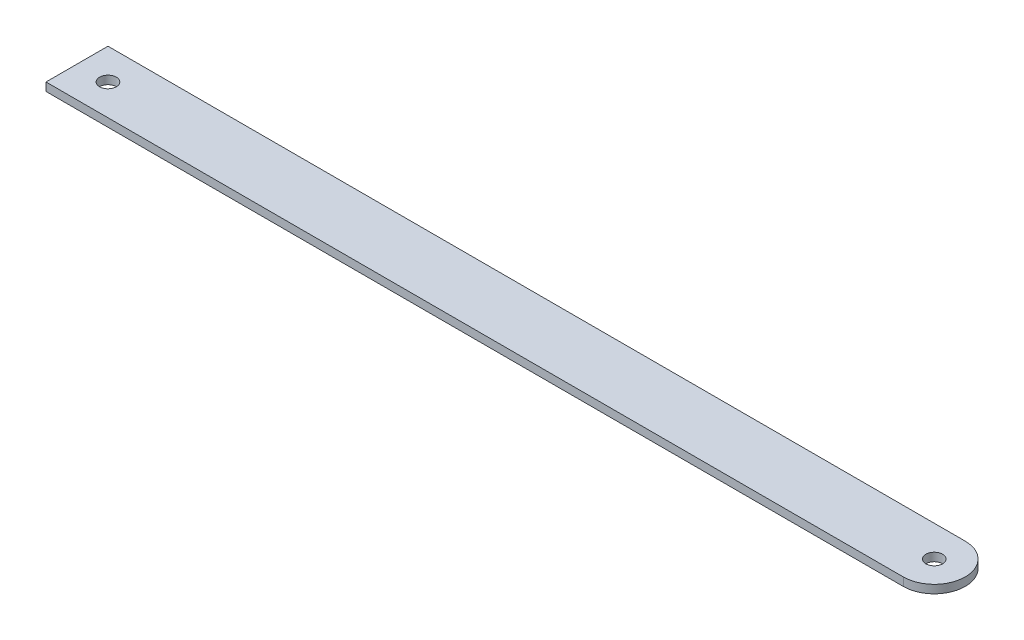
ISO-10303-21;
HEADER;
FILE_DESCRIPTION(('STEP AP214'),'2;1');
FILE_NAME('part.step','',(''),(''),'','','');
FILE_SCHEMA(('AUTOMOTIVE_DESIGN { 1 0 10303 214 1 1 1 1 }'));
ENDSEC;
DATA;
#1=APPLICATION_CONTEXT('core data for automotive mechanical design processes');
#2=APPLICATION_PROTOCOL_DEFINITION('international standard','automotive_design',2000,#1);
#3=PRODUCT_CONTEXT('',#1,'mechanical');
#4=PRODUCT('Part','Part','',(#3));
#5=PRODUCT_RELATED_PRODUCT_CATEGORY('part','',(#4));
#6=PRODUCT_DEFINITION_FORMATION('','',#4);
#7=PRODUCT_DEFINITION_CONTEXT('part definition',#1,'design');
#8=PRODUCT_DEFINITION('design','',#6,#7);
#9=PRODUCT_DEFINITION_SHAPE('','',#8);
#10=(LENGTH_UNIT() NAMED_UNIT(*) SI_UNIT(.MILLI.,.METRE.));
#11=(NAMED_UNIT(*) PLANE_ANGLE_UNIT() SI_UNIT($,.RADIAN.));
#12=(NAMED_UNIT(*) SI_UNIT($,.STERADIAN.) SOLID_ANGLE_UNIT());
#13=UNCERTAINTY_MEASURE_WITH_UNIT(LENGTH_MEASURE(1.E-05),#10,'distance_accuracy_value','');
#14=(GEOMETRIC_REPRESENTATION_CONTEXT(3) GLOBAL_UNCERTAINTY_ASSIGNED_CONTEXT((#13)) GLOBAL_UNIT_ASSIGNED_CONTEXT((#10,
#11,#12)) REPRESENTATION_CONTEXT('',''));
#15=CARTESIAN_POINT('',(0.,0.,0.));
#16=DIRECTION('',(0.,0.,1.));
#17=DIRECTION('',(1.,0.,0.));
#18=AXIS2_PLACEMENT_3D('',#15,#16,#17);
#19=CARTESIAN_POINT('',(2063.19961800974,4.,1775.27482915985));
#20=DIRECTION('',(0.,1.,0.));
#21=DIRECTION('',(0.,0.,-1.));
#22=AXIS2_PLACEMENT_3D('',#19,#20,#21);
#23=PLANE('',#22);
#24=CARTESIAN_POINT('',(2063.19961800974,4.,1775.27482915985));
#25=DIRECTION('',(0.,-1.,0.));
#26=DIRECTION('',(0.,0.,-1.));
#27=AXIS2_PLACEMENT_3D('',#24,#25,#26);
#28=CIRCLE('',#27,4.04999999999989);
#29=CARTESIAN_POINT('',(2063.19961800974,4.,1771.22482915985));
#30=VERTEX_POINT('',#29);
#31=EDGE_CURVE('E103',#30,#30,#28,.T.);
#32=ORIENTED_EDGE('',*,*,#31,.T.);
#33=EDGE_LOOP('',(#32));
#34=FACE_BOUND('',#33,.T.);
#35=CARTESIAN_POINT('',(2063.19961800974,4.,1775.27482915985));
#36=DIRECTION('',(0.,-1.,0.));
#37=DIRECTION('',(0.,0.,-1.));
#38=AXIS2_PLACEMENT_3D('',#35,#36,#37);
#39=CIRCLE('',#38,15.);
#40=CARTESIAN_POINT('',(2063.19961800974,4.,1760.27482915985));
#41=VERTEX_POINT('',#40);
#42=CARTESIAN_POINT('',(2063.19961800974,4.,1790.27482915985));
#43=VERTEX_POINT('',#42);
#44=EDGE_CURVE('E91',#41,#43,#39,.T.);
#45=ORIENTED_EDGE('',*,*,#44,.F.);
#46=DIRECTION('',(1.,0.,0.));
#47=VECTOR('',#46,1.);
#48=CARTESIAN_POINT('',(1648.19961800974,4.,1760.27482915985));
#49=LINE('',#48,#47);
#50=CARTESIAN_POINT('',(1648.19961800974,4.,1760.27482915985));
#51=VERTEX_POINT('',#50);
#52=EDGE_CURVE('E94',#51,#41,#49,.T.);
#53=ORIENTED_EDGE('',*,*,#52,.F.);
#54=DIRECTION('',(0.,0.,-1.));
#55=VECTOR('',#54,1.);
#56=CARTESIAN_POINT('',(1648.19961800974,4.,1790.27482915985));
#57=LINE('',#56,#55);
#58=CARTESIAN_POINT('',(1648.19961800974,4.,1790.27482915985));
#59=VERTEX_POINT('',#58);
#60=EDGE_CURVE('E82',#59,#51,#57,.T.);
#61=ORIENTED_EDGE('',*,*,#60,.F.);
#62=DIRECTION('',(-1.,0.,0.));
#63=VECTOR('',#62,1.);
#64=CARTESIAN_POINT('',(2063.19961800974,4.,1790.27482915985));
#65=LINE('',#64,#63);
#66=EDGE_CURVE('E87',#43,#59,#65,.T.);
#67=ORIENTED_EDGE('',*,*,#66,.F.);
#68=EDGE_LOOP('',(#45,#53,#61,#67));
#69=FACE_BOUND('',#68,.T.);
#70=CARTESIAN_POINT('',(1663.19961800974,4.,1775.27482915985));
#71=DIRECTION('',(0.,-1.,0.));
#72=DIRECTION('',(0.,0.,-1.));
#73=AXIS2_PLACEMENT_3D('',#70,#71,#72);
#74=CIRCLE('',#73,4.04999999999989);
#75=CARTESIAN_POINT('',(1663.19961800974,4.,1771.22482915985));
#76=VERTEX_POINT('',#75);
#77=EDGE_CURVE('E114',#76,#76,#74,.T.);
#78=ORIENTED_EDGE('',*,*,#77,.T.);
#79=EDGE_LOOP('',(#78));
#80=FACE_BOUND('',#79,.T.);
#81=ADVANCED_FACE('F35',(#34,#69,#80),#23,.T.);
#82=CARTESIAN_POINT('',(2063.19961800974,0.,1775.27482915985));
#83=DIRECTION('',(0.,1.,0.));
#84=DIRECTION('',(0.,0.,-1.));
#85=AXIS2_PLACEMENT_3D('',#82,#83,#84);
#86=PLANE('',#85);
#87=CARTESIAN_POINT('',(2063.19961800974,0.,1775.27482915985));
#88=DIRECTION('',(0.,-1.,0.));
#89=DIRECTION('',(0.,0.,-1.));
#90=AXIS2_PLACEMENT_3D('',#87,#88,#89);
#91=CIRCLE('',#90,4.04999999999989);
#92=CARTESIAN_POINT('',(2063.19961800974,0.,1771.22482915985));
#93=VERTEX_POINT('',#92);
#94=EDGE_CURVE('E111',#93,#93,#91,.T.);
#95=ORIENTED_EDGE('',*,*,#94,.F.);
#96=EDGE_LOOP('',(#95));
#97=FACE_BOUND('',#96,.T.);
#98=CARTESIAN_POINT('',(2063.19961800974,0.,1775.27482915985));
#99=DIRECTION('',(0.,-1.,0.));
#100=DIRECTION('',(0.,0.,-1.));
#101=AXIS2_PLACEMENT_3D('',#98,#99,#100);
#102=CIRCLE('',#101,15.);
#103=CARTESIAN_POINT('',(2063.19961800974,0.,1760.27482915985));
#104=VERTEX_POINT('',#103);
#105=CARTESIAN_POINT('',(2063.19961800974,0.,1790.27482915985));
#106=VERTEX_POINT('',#105);
#107=EDGE_CURVE('E99',#104,#106,#102,.T.);
#108=ORIENTED_EDGE('',*,*,#107,.T.);
#109=DIRECTION('',(-1.,0.,0.));
#110=VECTOR('',#109,1.);
#111=CARTESIAN_POINT('',(2063.19961800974,0.,1790.27482915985));
#112=LINE('',#111,#110);
#113=CARTESIAN_POINT('',(1648.19961800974,0.,1790.27482915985));
#114=VERTEX_POINT('',#113);
#115=EDGE_CURVE('E102',#106,#114,#112,.T.);
#116=ORIENTED_EDGE('',*,*,#115,.T.);
#117=DIRECTION('',(0.,0.,-1.));
#118=VECTOR('',#117,1.);
#119=CARTESIAN_POINT('',(1648.19961800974,0.,1790.27482915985));
#120=LINE('',#119,#118);
#121=CARTESIAN_POINT('',(1648.19961800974,0.,1760.27482915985));
#122=VERTEX_POINT('',#121);
#123=EDGE_CURVE('E85',#114,#122,#120,.T.);
#124=ORIENTED_EDGE('',*,*,#123,.T.);
#125=DIRECTION('',(1.,0.,0.));
#126=VECTOR('',#125,1.);
#127=CARTESIAN_POINT('',(1648.19961800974,0.,1760.27482915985));
#128=LINE('',#127,#126);
#129=EDGE_CURVE('E106',#122,#104,#128,.T.);
#130=ORIENTED_EDGE('',*,*,#129,.T.);
#131=EDGE_LOOP('',(#108,#116,#124,#130));
#132=FACE_BOUND('',#131,.T.);
#133=CARTESIAN_POINT('',(1663.19961800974,0.,1775.27482915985));
#134=DIRECTION('',(0.,-1.,0.));
#135=DIRECTION('',(0.,0.,-1.));
#136=AXIS2_PLACEMENT_3D('',#133,#134,#135);
#137=CIRCLE('',#136,4.04999999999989);
#138=CARTESIAN_POINT('',(1663.19961800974,0.,1771.22482915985));
#139=VERTEX_POINT('',#138);
#140=EDGE_CURVE('E117',#139,#139,#137,.T.);
#141=ORIENTED_EDGE('',*,*,#140,.F.);
#142=EDGE_LOOP('',(#141));
#143=FACE_BOUND('',#142,.T.);
#144=ADVANCED_FACE('F130',(#97,#132,#143),#86,.F.);
#145=CARTESIAN_POINT('',(2063.19961800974,4.,1775.27482915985));
#146=DIRECTION('',(0.,-1.,0.));
#147=DIRECTION('',(0.,0.,1.));
#148=AXIS2_PLACEMENT_3D('',#145,#146,#147);
#149=CYLINDRICAL_SURFACE('',#148,15.);
#150=ORIENTED_EDGE('',*,*,#107,.F.);
#151=DIRECTION('',(0.,-1.,0.));
#152=VECTOR('',#151,1.);
#153=CARTESIAN_POINT('',(2063.19961800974,4.,1760.27482915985));
#154=LINE('',#153,#152);
#155=EDGE_CURVE('E52',#41,#104,#154,.T.);
#156=ORIENTED_EDGE('',*,*,#155,.F.);
#157=ORIENTED_EDGE('',*,*,#44,.T.);
#158=DIRECTION('',(0.,-1.,0.));
#159=VECTOR('',#158,1.);
#160=CARTESIAN_POINT('',(2063.19961800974,4.,1790.27482915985));
#161=LINE('',#160,#159);
#162=EDGE_CURVE('E11',#43,#106,#161,.T.);
#163=ORIENTED_EDGE('',*,*,#162,.T.);
#164=EDGE_LOOP('',(#150,#156,#157,#163));
#165=FACE_BOUND('',#164,.T.);
#166=ADVANCED_FACE('F37',(#165),#149,.T.);
#167=CARTESIAN_POINT('',(2063.19961800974,4.,1790.27482915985));
#168=DIRECTION('',(0.,0.,-1.));
#169=DIRECTION('',(1.,0.,0.));
#170=AXIS2_PLACEMENT_3D('',#167,#168,#169);
#171=PLANE('',#170);
#172=ORIENTED_EDGE('',*,*,#115,.F.);
#173=ORIENTED_EDGE('',*,*,#162,.F.);
#174=ORIENTED_EDGE('',*,*,#66,.T.);
#175=DIRECTION('',(0.,-1.,0.));
#176=VECTOR('',#175,1.);
#177=CARTESIAN_POINT('',(1648.19961800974,4.,1790.27482915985));
#178=LINE('',#177,#176);
#179=EDGE_CURVE('E44',#59,#114,#178,.T.);
#180=ORIENTED_EDGE('',*,*,#179,.T.);
#181=EDGE_LOOP('',(#172,#173,#174,#180));
#182=FACE_BOUND('',#181,.T.);
#183=ADVANCED_FACE('F88',(#182),#171,.F.);
#184=CARTESIAN_POINT('',(1648.19961800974,4.,1790.27482915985));
#185=DIRECTION('',(1.,0.,0.));
#186=DIRECTION('',(0.,0.,1.));
#187=AXIS2_PLACEMENT_3D('',#184,#185,#186);
#188=PLANE('',#187);
#189=ORIENTED_EDGE('',*,*,#123,.F.);
#190=ORIENTED_EDGE('',*,*,#179,.F.);
#191=ORIENTED_EDGE('',*,*,#60,.T.);
#192=DIRECTION('',(0.,-1.,0.));
#193=VECTOR('',#192,1.);
#194=CARTESIAN_POINT('',(1648.19961800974,4.,1760.27482915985));
#195=LINE('',#194,#193);
#196=EDGE_CURVE('E68',#51,#122,#195,.T.);
#197=ORIENTED_EDGE('',*,*,#196,.T.);
#198=EDGE_LOOP('',(#189,#190,#191,#197));
#199=FACE_BOUND('',#198,.T.);
#200=ADVANCED_FACE('F80',(#199),#188,.F.);
#201=CARTESIAN_POINT('',(1648.19961800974,4.,1760.27482915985));
#202=DIRECTION('',(0.,0.,1.));
#203=DIRECTION('',(-1.,0.,0.));
#204=AXIS2_PLACEMENT_3D('',#201,#202,#203);
#205=PLANE('',#204);
#206=ORIENTED_EDGE('',*,*,#129,.F.);
#207=ORIENTED_EDGE('',*,*,#196,.F.);
#208=ORIENTED_EDGE('',*,*,#52,.T.);
#209=ORIENTED_EDGE('',*,*,#155,.T.);
#210=EDGE_LOOP('',(#206,#207,#208,#209));
#211=FACE_BOUND('',#210,.T.);
#212=ADVANCED_FACE('F143',(#211),#205,.F.);
#213=CARTESIAN_POINT('',(2063.19961800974,4.,1775.27482915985));
#214=DIRECTION('',(0.,-1.,0.));
#215=DIRECTION('',(0.,0.,1.));
#216=AXIS2_PLACEMENT_3D('',#213,#214,#215);
#217=CYLINDRICAL_SURFACE('',#216,4.04999999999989);
#218=ORIENTED_EDGE('',*,*,#31,.F.);
#219=EDGE_LOOP('',(#218));
#220=FACE_BOUND('',#219,.T.);
#221=ORIENTED_EDGE('',*,*,#94,.T.);
#222=EDGE_LOOP('',(#221));
#223=FACE_BOUND('',#222,.T.);
#224=ADVANCED_FACE('F126',(#220,#223),#217,.F.);
#225=CARTESIAN_POINT('',(1663.19961800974,4.,1775.27482915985));
#226=DIRECTION('',(0.,-1.,0.));
#227=DIRECTION('',(0.,0.,1.));
#228=AXIS2_PLACEMENT_3D('',#225,#226,#227);
#229=CYLINDRICAL_SURFACE('',#228,4.04999999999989);
#230=ORIENTED_EDGE('',*,*,#77,.F.);
#231=EDGE_LOOP('',(#230));
#232=FACE_BOUND('',#231,.T.);
#233=ORIENTED_EDGE('',*,*,#140,.T.);
#234=EDGE_LOOP('',(#233));
#235=FACE_BOUND('',#234,.T.);
#236=ADVANCED_FACE('F123',(#232,#235),#229,.F.);
#237=CLOSED_SHELL('',(#81,#144,#166,#183,#200,#212,#224,#236));
#238=MANIFOLD_SOLID_BREP('B2',#237);
#239=ADVANCED_BREP_SHAPE_REPRESENTATION('',(#18,#238),#14);
#240=SHAPE_DEFINITION_REPRESENTATION(#9,#239);
ENDSEC;
END-ISO-10303-21;
